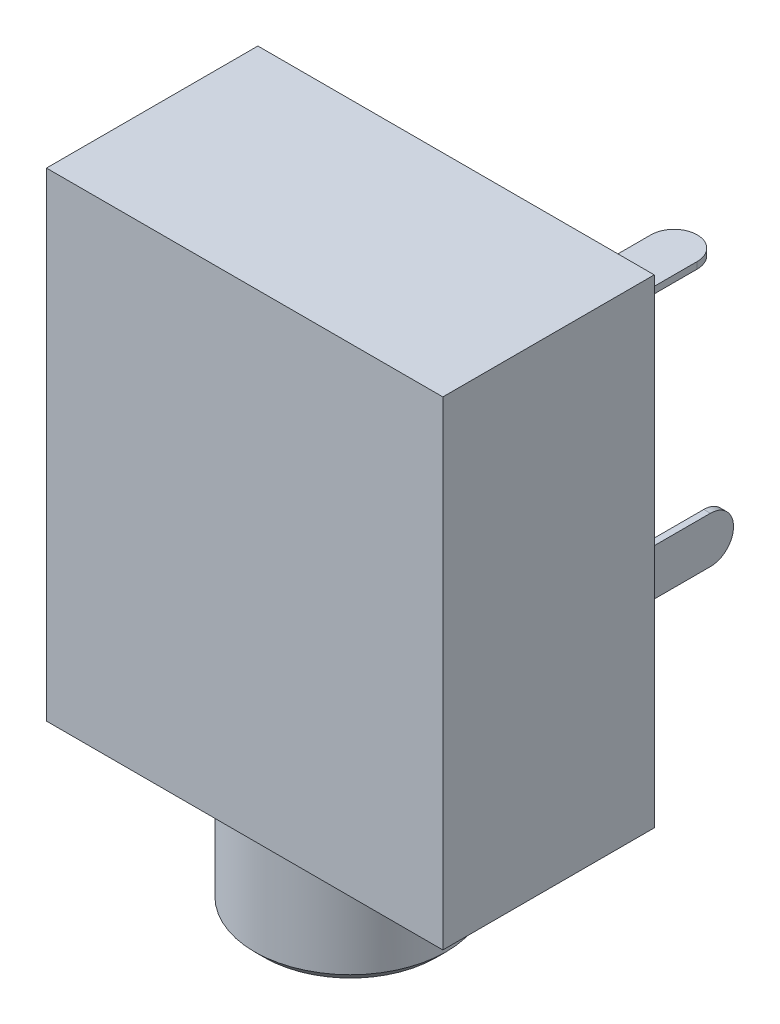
ISO-10303-21;
HEADER;
FILE_DESCRIPTION(('STEP AP214'),'2;1');
FILE_NAME('part.step','',(''),(''),'','','');
FILE_SCHEMA(('AUTOMOTIVE_DESIGN { 1 0 10303 214 1 1 1 1 }'));
ENDSEC;
DATA;
#1=APPLICATION_CONTEXT('core data for automotive mechanical design processes');
#2=APPLICATION_PROTOCOL_DEFINITION('international standard','automotive_design',2000,#1);
#3=PRODUCT_CONTEXT('',#1,'mechanical');
#4=PRODUCT('Part','Part','',(#3));
#5=PRODUCT_RELATED_PRODUCT_CATEGORY('part','',(#4));
#6=PRODUCT_DEFINITION_FORMATION('','',#4);
#7=PRODUCT_DEFINITION_CONTEXT('part definition',#1,'design');
#8=PRODUCT_DEFINITION('design','',#6,#7);
#9=PRODUCT_DEFINITION_SHAPE('','',#8);
#10=(LENGTH_UNIT() NAMED_UNIT(*) SI_UNIT(.MILLI.,.METRE.));
#11=(NAMED_UNIT(*) PLANE_ANGLE_UNIT() SI_UNIT($,.RADIAN.));
#12=(NAMED_UNIT(*) SI_UNIT($,.STERADIAN.) SOLID_ANGLE_UNIT());
#13=UNCERTAINTY_MEASURE_WITH_UNIT(LENGTH_MEASURE(1.E-05),#10,'distance_accuracy_value','');
#14=(GEOMETRIC_REPRESENTATION_CONTEXT(3) GLOBAL_UNCERTAINTY_ASSIGNED_CONTEXT((#13)) GLOBAL_UNIT_ASSIGNED_CONTEXT((#10,
#11,#12)) REPRESENTATION_CONTEXT('',''));
#15=CARTESIAN_POINT('',(0.,0.,0.));
#16=DIRECTION('',(0.,0.,1.));
#17=DIRECTION('',(1.,0.,0.));
#18=AXIS2_PLACEMENT_3D('',#15,#16,#17);
#19=CARTESIAN_POINT('',(0.,0.,6.4));
#20=DIRECTION('',(0.,1.,0.));
#21=DIRECTION('',(0.,0.,1.));
#22=AXIS2_PLACEMENT_3D('',#19,#20,#21);
#23=PLANE('',#22);
#24=DIRECTION('',(1.,0.,0.));
#25=VECTOR('',#24,1.);
#26=CARTESIAN_POINT('',(0.,0.,0.));
#27=LINE('',#26,#25);
#28=CARTESIAN_POINT('',(0.,0.,0.));
#29=VERTEX_POINT('',#28);
#30=CARTESIAN_POINT('',(12.,0.,0.));
#31=VERTEX_POINT('',#30);
#32=EDGE_CURVE('E331',#29,#31,#27,.T.);
#33=ORIENTED_EDGE('',*,*,#32,.T.);
#34=DIRECTION('',(0.,0.,-1.));
#35=VECTOR('',#34,1.);
#36=CARTESIAN_POINT('',(12.,0.,6.4));
#37=LINE('',#36,#35);
#38=CARTESIAN_POINT('',(12.,0.,6.4));
#39=VERTEX_POINT('',#38);
#40=EDGE_CURVE('E352',#39,#31,#37,.T.);
#41=ORIENTED_EDGE('',*,*,#40,.F.);
#42=DIRECTION('',(1.,0.,0.));
#43=VECTOR('',#42,1.);
#44=CARTESIAN_POINT('',(0.,0.,6.4));
#45=LINE('',#44,#43);
#46=CARTESIAN_POINT('',(0.,0.,6.4));
#47=VERTEX_POINT('',#46);
#48=EDGE_CURVE('E340',#47,#39,#45,.T.);
#49=ORIENTED_EDGE('',*,*,#48,.F.);
#50=DIRECTION('',(0.,0.,-1.));
#51=VECTOR('',#50,1.);
#52=CARTESIAN_POINT('',(0.,0.,6.4));
#53=LINE('',#52,#51);
#54=EDGE_CURVE('E355',#47,#29,#53,.T.);
#55=ORIENTED_EDGE('',*,*,#54,.T.);
#56=EDGE_LOOP('',(#33,#41,#49,#55));
#57=FACE_BOUND('',#56,.T.);
#58=CARTESIAN_POINT('',(6.,0.,3.2));
#59=DIRECTION('',(0.,1.,0.));
#60=DIRECTION('',(0.,0.,1.));
#61=AXIS2_PLACEMENT_3D('',#58,#59,#60);
#62=CIRCLE('',#61,2.9);
#63=CARTESIAN_POINT('',(6.,0.,6.1));
#64=VERTEX_POINT('',#63);
#65=EDGE_CURVE('E419',#64,#64,#62,.F.);
#66=ORIENTED_EDGE('',*,*,#65,.F.);
#67=EDGE_LOOP('',(#66));
#68=FACE_BOUND('',#67,.T.);
#69=ADVANCED_FACE('F24',(#57,#68),#23,.F.);
#70=CARTESIAN_POINT('',(0.,0.,0.));
#71=DIRECTION('',(0.,0.,1.));
#72=DIRECTION('',(1.,0.,0.));
#73=AXIS2_PLACEMENT_3D('',#70,#71,#72);
#74=PLANE('',#73);
#75=DIRECTION('',(0.,1.,0.));
#76=VECTOR('',#75,1.);
#77=CARTESIAN_POINT('',(1.2,10.,0.));
#78=LINE('',#77,#76);
#79=CARTESIAN_POINT('',(1.2,8.60000000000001,0.));
#80=VERTEX_POINT('',#79);
#81=CARTESIAN_POINT('',(1.2,10.,0.));
#82=VERTEX_POINT('',#81);
#83=EDGE_CURVE('E248',#80,#82,#78,.T.);
#84=ORIENTED_EDGE('',*,*,#83,.F.);
#85=DIRECTION('',(-1.,0.,0.));
#86=VECTOR('',#85,1.);
#87=CARTESIAN_POINT('',(1.2,8.60000000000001,0.));
#88=LINE('',#87,#86);
#89=CARTESIAN_POINT('',(1.4,8.60000000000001,0.));
#90=VERTEX_POINT('',#89);
#91=EDGE_CURVE('E257',#90,#80,#88,.T.);
#92=ORIENTED_EDGE('',*,*,#91,.F.);
#93=DIRECTION('',(0.,-1.,0.));
#94=VECTOR('',#93,1.);
#95=CARTESIAN_POINT('',(1.4,10.,0.));
#96=LINE('',#95,#94);
#97=CARTESIAN_POINT('',(1.4,10.,0.));
#98=VERTEX_POINT('',#97);
#99=EDGE_CURVE('E254',#98,#90,#96,.T.);
#100=ORIENTED_EDGE('',*,*,#99,.F.);
#101=DIRECTION('',(1.,0.,0.));
#102=VECTOR('',#101,1.);
#103=CARTESIAN_POINT('',(1.2,10.,0.));
#104=LINE('',#103,#102);
#105=EDGE_CURVE('E251',#82,#98,#104,.T.);
#106=ORIENTED_EDGE('',*,*,#105,.F.);
#107=EDGE_LOOP('',(#84,#92,#100,#106));
#108=FACE_BOUND('',#107,.T.);
#109=DIRECTION('',(0.,1.,0.));
#110=VECTOR('',#109,1.);
#111=CARTESIAN_POINT('',(10.7,6.30000000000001,0.));
#112=LINE('',#111,#110);
#113=CARTESIAN_POINT('',(10.7,4.9,0.));
#114=VERTEX_POINT('',#113);
#115=CARTESIAN_POINT('',(10.7,6.30000000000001,0.));
#116=VERTEX_POINT('',#115);
#117=EDGE_CURVE('E288',#114,#116,#112,.T.);
#118=ORIENTED_EDGE('',*,*,#117,.F.);
#119=DIRECTION('',(-1.,0.,0.));
#120=VECTOR('',#119,1.);
#121=CARTESIAN_POINT('',(10.7,4.9,0.));
#122=LINE('',#121,#120);
#123=CARTESIAN_POINT('',(10.9,4.9,0.));
#124=VERTEX_POINT('',#123);
#125=EDGE_CURVE('E297',#124,#114,#122,.T.);
#126=ORIENTED_EDGE('',*,*,#125,.F.);
#127=DIRECTION('',(0.,-1.,0.));
#128=VECTOR('',#127,1.);
#129=CARTESIAN_POINT('',(10.9,6.30000000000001,0.));
#130=LINE('',#129,#128);
#131=CARTESIAN_POINT('',(10.9,6.30000000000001,0.));
#132=VERTEX_POINT('',#131);
#133=EDGE_CURVE('E294',#132,#124,#130,.T.);
#134=ORIENTED_EDGE('',*,*,#133,.F.);
#135=DIRECTION('',(1.,0.,0.));
#136=VECTOR('',#135,1.);
#137=CARTESIAN_POINT('',(10.7,6.30000000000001,0.));
#138=LINE('',#137,#136);
#139=EDGE_CURVE('E291',#116,#132,#138,.T.);
#140=ORIENTED_EDGE('',*,*,#139,.F.);
#141=EDGE_LOOP('',(#118,#126,#134,#140));
#142=FACE_BOUND('',#141,.T.);
#143=DIRECTION('',(0.,-1.,0.));
#144=VECTOR('',#143,1.);
#145=CARTESIAN_POINT('',(0.,14.5,0.));
#146=LINE('',#145,#144);
#147=CARTESIAN_POINT('',(0.,14.5,0.));
#148=VERTEX_POINT('',#147);
#149=EDGE_CURVE('E328',#148,#29,#146,.T.);
#150=ORIENTED_EDGE('',*,*,#149,.F.);
#151=DIRECTION('',(-1.,0.,0.));
#152=VECTOR('',#151,1.);
#153=CARTESIAN_POINT('',(0.,14.5,0.));
#154=LINE('',#153,#152);
#155=CARTESIAN_POINT('',(12.,14.5,0.));
#156=VERTEX_POINT('',#155);
#157=EDGE_CURVE('E335',#156,#148,#154,.T.);
#158=ORIENTED_EDGE('',*,*,#157,.F.);
#159=DIRECTION('',(0.,1.,0.));
#160=VECTOR('',#159,1.);
#161=CARTESIAN_POINT('',(12.,14.5,0.));
#162=LINE('',#161,#160);
#163=EDGE_CURVE('E333',#31,#156,#162,.T.);
#164=ORIENTED_EDGE('',*,*,#163,.F.);
#165=ORIENTED_EDGE('',*,*,#32,.F.);
#166=EDGE_LOOP('',(#150,#158,#164,#165));
#167=FACE_BOUND('',#166,.T.);
#168=DIRECTION('',(0.,1.,0.));
#169=VECTOR('',#168,1.);
#170=CARTESIAN_POINT('',(9.10000000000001,12.5,0.));
#171=LINE('',#170,#169);
#172=CARTESIAN_POINT('',(9.10000000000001,12.5,0.));
#173=VERTEX_POINT('',#172);
#174=CARTESIAN_POINT('',(9.10000000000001,12.7,0.));
#175=VERTEX_POINT('',#174);
#176=EDGE_CURVE('E308',#173,#175,#171,.T.);
#177=ORIENTED_EDGE('',*,*,#176,.F.);
#178=DIRECTION('',(-1.,0.,0.));
#179=VECTOR('',#178,1.);
#180=CARTESIAN_POINT('',(9.10000000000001,12.5,0.));
#181=LINE('',#180,#179);
#182=CARTESIAN_POINT('',(10.5,12.5,0.));
#183=VERTEX_POINT('',#182);
#184=EDGE_CURVE('E317',#183,#173,#181,.T.);
#185=ORIENTED_EDGE('',*,*,#184,.F.);
#186=DIRECTION('',(0.,-1.,0.));
#187=VECTOR('',#186,1.);
#188=CARTESIAN_POINT('',(10.5,12.5,0.));
#189=LINE('',#188,#187);
#190=CARTESIAN_POINT('',(10.5,12.7,0.));
#191=VERTEX_POINT('',#190);
#192=EDGE_CURVE('E314',#191,#183,#189,.T.);
#193=ORIENTED_EDGE('',*,*,#192,.F.);
#194=DIRECTION('',(1.,0.,0.));
#195=VECTOR('',#194,1.);
#196=CARTESIAN_POINT('',(9.10000000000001,12.7,0.));
#197=LINE('',#196,#195);
#198=EDGE_CURVE('E311',#175,#191,#197,.T.);
#199=ORIENTED_EDGE('',*,*,#198,.F.);
#200=EDGE_LOOP('',(#177,#185,#193,#199));
#201=FACE_BOUND('',#200,.T.);
#202=DIRECTION('',(0.,1.,0.));
#203=VECTOR('',#202,1.);
#204=CARTESIAN_POINT('',(3.6,8.80000000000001,0.));
#205=LINE('',#204,#203);
#206=CARTESIAN_POINT('',(3.6,7.40000000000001,0.));
#207=VERTEX_POINT('',#206);
#208=CARTESIAN_POINT('',(3.6,8.80000000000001,0.));
#209=VERTEX_POINT('',#208);
#210=EDGE_CURVE('E268',#207,#209,#205,.T.);
#211=ORIENTED_EDGE('',*,*,#210,.F.);
#212=DIRECTION('',(-1.,0.,0.));
#213=VECTOR('',#212,1.);
#214=CARTESIAN_POINT('',(3.6,7.40000000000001,0.));
#215=LINE('',#214,#213);
#216=CARTESIAN_POINT('',(3.8,7.40000000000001,0.));
#217=VERTEX_POINT('',#216);
#218=EDGE_CURVE('E277',#217,#207,#215,.T.);
#219=ORIENTED_EDGE('',*,*,#218,.F.);
#220=DIRECTION('',(0.,-1.,0.));
#221=VECTOR('',#220,1.);
#222=CARTESIAN_POINT('',(3.8,8.80000000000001,0.));
#223=LINE('',#222,#221);
#224=CARTESIAN_POINT('',(3.8,8.80000000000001,0.));
#225=VERTEX_POINT('',#224);
#226=EDGE_CURVE('E274',#225,#217,#223,.T.);
#227=ORIENTED_EDGE('',*,*,#226,.F.);
#228=DIRECTION('',(1.,0.,0.));
#229=VECTOR('',#228,1.);
#230=CARTESIAN_POINT('',(3.6,8.80000000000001,0.));
#231=LINE('',#230,#229);
#232=EDGE_CURVE('E271',#209,#225,#231,.T.);
#233=ORIENTED_EDGE('',*,*,#232,.F.);
#234=EDGE_LOOP('',(#211,#219,#227,#233));
#235=FACE_BOUND('',#234,.T.);
#236=DIRECTION('',(0.,1.,0.));
#237=VECTOR('',#236,1.);
#238=CARTESIAN_POINT('',(5.30000000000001,0.700000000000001,0.));
#239=LINE('',#238,#237);
#240=CARTESIAN_POINT('',(5.30000000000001,0.700000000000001,0.));
#241=VERTEX_POINT('',#240);
#242=CARTESIAN_POINT('',(5.30000000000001,0.900000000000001,0.));
#243=VERTEX_POINT('',#242);
#244=EDGE_CURVE('E218',#241,#243,#239,.T.);
#245=ORIENTED_EDGE('',*,*,#244,.F.);
#246=DIRECTION('',(-1.,0.,0.));
#247=VECTOR('',#246,1.);
#248=CARTESIAN_POINT('',(5.30000000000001,0.700000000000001,0.));
#249=LINE('',#248,#247);
#250=CARTESIAN_POINT('',(6.70000000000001,0.700000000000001,0.));
#251=VERTEX_POINT('',#250);
#252=EDGE_CURVE('E224',#251,#241,#249,.T.);
#253=ORIENTED_EDGE('',*,*,#252,.F.);
#254=DIRECTION('',(0.,-1.,0.));
#255=VECTOR('',#254,1.);
#256=CARTESIAN_POINT('',(6.70000000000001,0.700000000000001,0.));
#257=LINE('',#256,#255);
#258=CARTESIAN_POINT('',(6.70000000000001,0.900000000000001,0.));
#259=VERTEX_POINT('',#258);
#260=EDGE_CURVE('E238',#259,#251,#257,.T.);
#261=ORIENTED_EDGE('',*,*,#260,.F.);
#262=DIRECTION('',(1.,0.,0.));
#263=VECTOR('',#262,1.);
#264=CARTESIAN_POINT('',(5.30000000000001,0.900000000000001,0.));
#265=LINE('',#264,#263);
#266=EDGE_CURVE('E233',#243,#259,#265,.T.);
#267=ORIENTED_EDGE('',*,*,#266,.F.);
#268=EDGE_LOOP('',(#245,#253,#261,#267));
#269=FACE_BOUND('',#268,.T.);
#270=ADVANCED_FACE('F229',(#108,#142,#167,#201,#235,#269),#74,.F.);
#271=CARTESIAN_POINT('',(0.,14.5,6.4));
#272=DIRECTION('',(1.,0.,0.));
#273=DIRECTION('',(0.,0.,-1.));
#274=AXIS2_PLACEMENT_3D('',#271,#272,#273);
#275=PLANE('',#274);
#276=ORIENTED_EDGE('',*,*,#149,.T.);
#277=ORIENTED_EDGE('',*,*,#54,.F.);
#278=DIRECTION('',(0.,-1.,0.));
#279=VECTOR('',#278,1.);
#280=CARTESIAN_POINT('',(0.,14.5,6.4));
#281=LINE('',#280,#279);
#282=CARTESIAN_POINT('',(0.,14.5,6.4));
#283=VERTEX_POINT('',#282);
#284=EDGE_CURVE('E337',#283,#47,#281,.T.);
#285=ORIENTED_EDGE('',*,*,#284,.F.);
#286=DIRECTION('',(0.,0.,-1.));
#287=VECTOR('',#286,1.);
#288=CARTESIAN_POINT('',(0.,14.5,6.4));
#289=LINE('',#288,#287);
#290=EDGE_CURVE('E346',#283,#148,#289,.T.);
#291=ORIENTED_EDGE('',*,*,#290,.T.);
#292=EDGE_LOOP('',(#276,#277,#285,#291));
#293=FACE_BOUND('',#292,.T.);
#294=ADVANCED_FACE('F26',(#293),#275,.F.);
#295=CARTESIAN_POINT('',(12.,14.5,6.4));
#296=DIRECTION('',(-1.,0.,0.));
#297=DIRECTION('',(0.,0.,1.));
#298=AXIS2_PLACEMENT_3D('',#295,#296,#297);
#299=PLANE('',#298);
#300=ORIENTED_EDGE('',*,*,#163,.T.);
#301=DIRECTION('',(0.,0.,-1.));
#302=VECTOR('',#301,1.);
#303=CARTESIAN_POINT('',(12.,14.5,6.4));
#304=LINE('',#303,#302);
#305=CARTESIAN_POINT('',(12.,14.5,6.4));
#306=VERTEX_POINT('',#305);
#307=EDGE_CURVE('E349',#306,#156,#304,.T.);
#308=ORIENTED_EDGE('',*,*,#307,.F.);
#309=DIRECTION('',(0.,1.,0.));
#310=VECTOR('',#309,1.);
#311=CARTESIAN_POINT('',(12.,14.5,6.4));
#312=LINE('',#311,#310);
#313=EDGE_CURVE('E342',#39,#306,#312,.T.);
#314=ORIENTED_EDGE('',*,*,#313,.F.);
#315=ORIENTED_EDGE('',*,*,#40,.T.);
#316=EDGE_LOOP('',(#300,#308,#314,#315));
#317=FACE_BOUND('',#316,.T.);
#318=ADVANCED_FACE('F454',(#317),#299,.F.);
#319=CARTESIAN_POINT('',(0.,14.5,6.4));
#320=DIRECTION('',(0.,-1.,0.));
#321=DIRECTION('',(0.,0.,-1.));
#322=AXIS2_PLACEMENT_3D('',#319,#320,#321);
#323=PLANE('',#322);
#324=ORIENTED_EDGE('',*,*,#157,.T.);
#325=ORIENTED_EDGE('',*,*,#290,.F.);
#326=DIRECTION('',(-1.,0.,0.));
#327=VECTOR('',#326,1.);
#328=CARTESIAN_POINT('',(0.,14.5,6.4));
#329=LINE('',#328,#327);
#330=EDGE_CURVE('E344',#306,#283,#329,.T.);
#331=ORIENTED_EDGE('',*,*,#330,.F.);
#332=ORIENTED_EDGE('',*,*,#307,.T.);
#333=EDGE_LOOP('',(#324,#325,#331,#332));
#334=FACE_BOUND('',#333,.T.);
#335=ADVANCED_FACE('F457',(#334),#323,.F.);
#336=CARTESIAN_POINT('',(0.,0.,6.4));
#337=DIRECTION('',(0.,0.,1.));
#338=DIRECTION('',(1.,0.,0.));
#339=AXIS2_PLACEMENT_3D('',#336,#337,#338);
#340=PLANE('',#339);
#341=ORIENTED_EDGE('',*,*,#284,.T.);
#342=ORIENTED_EDGE('',*,*,#48,.T.);
#343=ORIENTED_EDGE('',*,*,#313,.T.);
#344=ORIENTED_EDGE('',*,*,#330,.T.);
#345=EDGE_LOOP('',(#341,#342,#343,#344));
#346=FACE_BOUND('',#345,.T.);
#347=ADVANCED_FACE('F461',(#346),#340,.T.);
#348=CARTESIAN_POINT('',(9.10000000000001,12.5,-3.5));
#349=DIRECTION('',(1.,0.,0.));
#350=DIRECTION('',(0.,0.,-1.));
#351=AXIS2_PLACEMENT_3D('',#348,#349,#350);
#352=PLANE('',#351);
#353=DIRECTION('',(0.,0.,1.));
#354=VECTOR('',#353,1.);
#355=CARTESIAN_POINT('',(9.10000000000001,12.7,-3.5));
#356=LINE('',#355,#354);
#357=CARTESIAN_POINT('',(9.10000000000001,12.7,-2.8));
#358=VERTEX_POINT('',#357);
#359=EDGE_CURVE('E326',#358,#175,#356,.T.);
#360=ORIENTED_EDGE('',*,*,#359,.F.);
#361=DIRECTION('',(0.,1.,0.));
#362=VECTOR('',#361,1.);
#363=CARTESIAN_POINT('',(9.10000000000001,12.5,-2.8));
#364=LINE('',#363,#362);
#365=CARTESIAN_POINT('',(9.10000000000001,12.5,-2.8));
#366=VERTEX_POINT('',#365);
#367=EDGE_CURVE('E412',#358,#366,#364,.F.);
#368=ORIENTED_EDGE('',*,*,#367,.T.);
#369=DIRECTION('',(0.,0.,1.));
#370=VECTOR('',#369,1.);
#371=CARTESIAN_POINT('',(9.10000000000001,12.5,-3.5));
#372=LINE('',#371,#370);
#373=EDGE_CURVE('E320',#366,#173,#372,.T.);
#374=ORIENTED_EDGE('',*,*,#373,.T.);
#375=ORIENTED_EDGE('',*,*,#176,.T.);
#376=EDGE_LOOP('',(#360,#368,#374,#375));
#377=FACE_BOUND('',#376,.T.);
#378=ADVANCED_FACE('F464',(#377),#352,.F.);
#379=CARTESIAN_POINT('',(9.10000000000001,12.7,-3.5));
#380=DIRECTION('',(0.,-1.,0.));
#381=DIRECTION('',(0.,0.,-1.));
#382=AXIS2_PLACEMENT_3D('',#379,#380,#381);
#383=PLANE('',#382);
#384=CARTESIAN_POINT('',(9.80000000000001,12.7,-2.8));
#385=DIRECTION('',(0.,-1.,0.));
#386=DIRECTION('',(0.,0.,-1.));
#387=AXIS2_PLACEMENT_3D('',#384,#385,#386);
#388=CIRCLE('',#387,0.7);
#389=CARTESIAN_POINT('',(10.5,12.7,-2.8));
#390=VERTEX_POINT('',#389);
#391=CARTESIAN_POINT('',(9.80000000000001,12.7,-3.5));
#392=VERTEX_POINT('',#391);
#393=EDGE_CURVE('E408',#390,#392,#388,.F.);
#394=ORIENTED_EDGE('',*,*,#393,.T.);
#395=CARTESIAN_POINT('',(9.80000000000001,12.7,-2.8));
#396=DIRECTION('',(0.,-1.,0.));
#397=DIRECTION('',(0.,0.,-1.));
#398=AXIS2_PLACEMENT_3D('',#395,#396,#397);
#399=CIRCLE('',#398,0.7);
#400=EDGE_CURVE('E410',#392,#358,#399,.F.);
#401=ORIENTED_EDGE('',*,*,#400,.T.);
#402=ORIENTED_EDGE('',*,*,#359,.T.);
#403=ORIENTED_EDGE('',*,*,#198,.T.);
#404=DIRECTION('',(0.,0.,1.));
#405=VECTOR('',#404,1.);
#406=CARTESIAN_POINT('',(10.5,12.7,-3.5));
#407=LINE('',#406,#405);
#408=EDGE_CURVE('E324',#390,#191,#407,.T.);
#409=ORIENTED_EDGE('',*,*,#408,.F.);
#410=EDGE_LOOP('',(#394,#401,#402,#403,#409));
#411=FACE_BOUND('',#410,.T.);
#412=ADVANCED_FACE('F469',(#411),#383,.F.);
#413=CARTESIAN_POINT('',(10.5,12.5,-3.5));
#414=DIRECTION('',(-1.,0.,0.));
#415=DIRECTION('',(0.,0.,1.));
#416=AXIS2_PLACEMENT_3D('',#413,#414,#415);
#417=PLANE('',#416);
#418=DIRECTION('',(0.,0.,1.));
#419=VECTOR('',#418,1.);
#420=CARTESIAN_POINT('',(10.5,12.5,-3.5));
#421=LINE('',#420,#419);
#422=CARTESIAN_POINT('',(10.5,12.5,-2.8));
#423=VERTEX_POINT('',#422);
#424=EDGE_CURVE('E322',#423,#183,#421,.T.);
#425=ORIENTED_EDGE('',*,*,#424,.F.);
#426=DIRECTION('',(0.,-1.,0.));
#427=VECTOR('',#426,1.);
#428=CARTESIAN_POINT('',(10.5,12.7,-2.8));
#429=LINE('',#428,#427);
#430=EDGE_CURVE('E417',#423,#390,#429,.F.);
#431=ORIENTED_EDGE('',*,*,#430,.T.);
#432=ORIENTED_EDGE('',*,*,#408,.T.);
#433=ORIENTED_EDGE('',*,*,#192,.T.);
#434=EDGE_LOOP('',(#425,#431,#432,#433));
#435=FACE_BOUND('',#434,.T.);
#436=ADVANCED_FACE('F473',(#435),#417,.F.);
#437=CARTESIAN_POINT('',(9.10000000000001,12.5,-3.5));
#438=DIRECTION('',(0.,1.,0.));
#439=DIRECTION('',(0.,0.,1.));
#440=AXIS2_PLACEMENT_3D('',#437,#438,#439);
#441=PLANE('',#440);
#442=ORIENTED_EDGE('',*,*,#373,.F.);
#443=CARTESIAN_POINT('',(9.80000000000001,12.5,-2.8));
#444=DIRECTION('',(0.,1.,0.));
#445=DIRECTION('',(0.,0.,1.));
#446=AXIS2_PLACEMENT_3D('',#443,#444,#445);
#447=CIRCLE('',#446,0.7);
#448=CARTESIAN_POINT('',(9.80000000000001,12.5,-3.5));
#449=VERTEX_POINT('',#448);
#450=EDGE_CURVE('E44',#366,#449,#447,.F.);
#451=ORIENTED_EDGE('',*,*,#450,.T.);
#452=CARTESIAN_POINT('',(9.80000000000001,12.5,-2.8));
#453=DIRECTION('',(0.,1.,0.));
#454=DIRECTION('',(0.,0.,1.));
#455=AXIS2_PLACEMENT_3D('',#452,#453,#454);
#456=CIRCLE('',#455,0.7);
#457=EDGE_CURVE('E39',#449,#423,#456,.F.);
#458=ORIENTED_EDGE('',*,*,#457,.T.);
#459=ORIENTED_EDGE('',*,*,#424,.T.);
#460=ORIENTED_EDGE('',*,*,#184,.T.);
#461=EDGE_LOOP('',(#442,#451,#458,#459,#460));
#462=FACE_BOUND('',#461,.T.);
#463=ADVANCED_FACE('F477',(#462),#441,.F.);
#464=CARTESIAN_POINT('',(10.7,6.30000000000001,-3.5));
#465=DIRECTION('',(1.,0.,0.));
#466=DIRECTION('',(0.,0.,-1.));
#467=AXIS2_PLACEMENT_3D('',#464,#465,#466);
#468=PLANE('',#467);
#469=CARTESIAN_POINT('',(10.7,5.60000000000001,-2.8));
#470=DIRECTION('',(1.,0.,0.));
#471=DIRECTION('',(0.,0.,-1.));
#472=AXIS2_PLACEMENT_3D('',#469,#470,#471);
#473=CIRCLE('',#472,0.7);
#474=CARTESIAN_POINT('',(10.7,6.30000000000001,-2.8));
#475=VERTEX_POINT('',#474);
#476=CARTESIAN_POINT('',(10.7,5.60000000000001,-3.5));
#477=VERTEX_POINT('',#476);
#478=EDGE_CURVE('E395',#475,#477,#473,.F.);
#479=ORIENTED_EDGE('',*,*,#478,.T.);
#480=CARTESIAN_POINT('',(10.7,5.6,-2.8));
#481=DIRECTION('',(1.,0.,0.));
#482=DIRECTION('',(0.,0.,-1.));
#483=AXIS2_PLACEMENT_3D('',#480,#481,#482);
#484=CIRCLE('',#483,0.7);
#485=CARTESIAN_POINT('',(10.7,4.9,-2.8));
#486=VERTEX_POINT('',#485);
#487=EDGE_CURVE('E397',#477,#486,#484,.F.);
#488=ORIENTED_EDGE('',*,*,#487,.T.);
#489=DIRECTION('',(0.,0.,1.));
#490=VECTOR('',#489,1.);
#491=CARTESIAN_POINT('',(10.7,4.9,-3.5));
#492=LINE('',#491,#490);
#493=EDGE_CURVE('E300',#486,#114,#492,.T.);
#494=ORIENTED_EDGE('',*,*,#493,.T.);
#495=ORIENTED_EDGE('',*,*,#117,.T.);
#496=DIRECTION('',(0.,0.,1.));
#497=VECTOR('',#496,1.);
#498=CARTESIAN_POINT('',(10.7,6.30000000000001,-3.5));
#499=LINE('',#498,#497);
#500=EDGE_CURVE('E306',#475,#116,#499,.T.);
#501=ORIENTED_EDGE('',*,*,#500,.F.);
#502=EDGE_LOOP('',(#479,#488,#494,#495,#501));
#503=FACE_BOUND('',#502,.T.);
#504=ADVANCED_FACE('F481',(#503),#468,.F.);
#505=CARTESIAN_POINT('',(10.7,6.30000000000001,-3.5));
#506=DIRECTION('',(0.,-1.,0.));
#507=DIRECTION('',(0.,0.,-1.));
#508=AXIS2_PLACEMENT_3D('',#505,#506,#507);
#509=PLANE('',#508);
#510=DIRECTION('',(0.,0.,1.));
#511=VECTOR('',#510,1.);
#512=CARTESIAN_POINT('',(10.9,6.30000000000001,-3.5));
#513=LINE('',#512,#511);
#514=CARTESIAN_POINT('',(10.9,6.30000000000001,-2.8));
#515=VERTEX_POINT('',#514);
#516=EDGE_CURVE('E304',#515,#132,#513,.T.);
#517=ORIENTED_EDGE('',*,*,#516,.F.);
#518=DIRECTION('',(1.,0.,0.));
#519=VECTOR('',#518,1.);
#520=CARTESIAN_POINT('',(10.7,6.30000000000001,-2.8));
#521=LINE('',#520,#519);
#522=EDGE_CURVE('E406',#515,#475,#521,.F.);
#523=ORIENTED_EDGE('',*,*,#522,.T.);
#524=ORIENTED_EDGE('',*,*,#500,.T.);
#525=ORIENTED_EDGE('',*,*,#139,.T.);
#526=EDGE_LOOP('',(#517,#523,#524,#525));
#527=FACE_BOUND('',#526,.T.);
#528=ADVANCED_FACE('F484',(#527),#509,.F.);
#529=CARTESIAN_POINT('',(10.9,6.30000000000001,-3.5));
#530=DIRECTION('',(-1.,0.,0.));
#531=DIRECTION('',(0.,0.,1.));
#532=AXIS2_PLACEMENT_3D('',#529,#530,#531);
#533=PLANE('',#532);
#534=DIRECTION('',(0.,0.,1.));
#535=VECTOR('',#534,1.);
#536=CARTESIAN_POINT('',(10.9,4.9,-3.5));
#537=LINE('',#536,#535);
#538=CARTESIAN_POINT('',(10.9,4.9,-2.8));
#539=VERTEX_POINT('',#538);
#540=EDGE_CURVE('E302',#539,#124,#537,.T.);
#541=ORIENTED_EDGE('',*,*,#540,.F.);
#542=CARTESIAN_POINT('',(10.9,5.6,-2.8));
#543=DIRECTION('',(-1.,0.,0.));
#544=DIRECTION('',(0.,0.,1.));
#545=AXIS2_PLACEMENT_3D('',#542,#543,#544);
#546=CIRCLE('',#545,0.7);
#547=CARTESIAN_POINT('',(10.9,5.60000000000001,-3.5));
#548=VERTEX_POINT('',#547);
#549=EDGE_CURVE('E404',#539,#548,#546,.F.);
#550=ORIENTED_EDGE('',*,*,#549,.T.);
#551=CARTESIAN_POINT('',(10.9,5.60000000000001,-2.8));
#552=DIRECTION('',(-1.,0.,0.));
#553=DIRECTION('',(0.,0.,1.));
#554=AXIS2_PLACEMENT_3D('',#551,#552,#553);
#555=CIRCLE('',#554,0.7);
#556=EDGE_CURVE('E402',#548,#515,#555,.F.);
#557=ORIENTED_EDGE('',*,*,#556,.T.);
#558=ORIENTED_EDGE('',*,*,#516,.T.);
#559=ORIENTED_EDGE('',*,*,#133,.T.);
#560=EDGE_LOOP('',(#541,#550,#557,#558,#559));
#561=FACE_BOUND('',#560,.T.);
#562=ADVANCED_FACE('F488',(#561),#533,.F.);
#563=CARTESIAN_POINT('',(10.7,4.9,-3.5));
#564=DIRECTION('',(0.,1.,0.));
#565=DIRECTION('',(0.,0.,1.));
#566=AXIS2_PLACEMENT_3D('',#563,#564,#565);
#567=PLANE('',#566);
#568=ORIENTED_EDGE('',*,*,#493,.F.);
#569=DIRECTION('',(-1.,0.,0.));
#570=VECTOR('',#569,1.);
#571=CARTESIAN_POINT('',(10.7,4.9,-2.8));
#572=LINE('',#571,#570);
#573=EDGE_CURVE('E399',#486,#539,#572,.F.);
#574=ORIENTED_EDGE('',*,*,#573,.T.);
#575=ORIENTED_EDGE('',*,*,#540,.T.);
#576=ORIENTED_EDGE('',*,*,#125,.T.);
#577=EDGE_LOOP('',(#568,#574,#575,#576));
#578=FACE_BOUND('',#577,.T.);
#579=ADVANCED_FACE('F492',(#578),#567,.F.);
#580=CARTESIAN_POINT('',(3.6,8.80000000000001,-3.5));
#581=DIRECTION('',(1.,0.,0.));
#582=DIRECTION('',(0.,0.,-1.));
#583=AXIS2_PLACEMENT_3D('',#580,#581,#582);
#584=PLANE('',#583);
#585=DIRECTION('',(0.,0.,1.));
#586=VECTOR('',#585,1.);
#587=CARTESIAN_POINT('',(3.6,8.80000000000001,-3.5));
#588=LINE('',#587,#586);
#589=CARTESIAN_POINT('',(3.6,8.80000000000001,-2.8));
#590=VERTEX_POINT('',#589);
#591=EDGE_CURVE('E286',#590,#209,#588,.T.);
#592=ORIENTED_EDGE('',*,*,#591,.F.);
#593=CARTESIAN_POINT('',(3.6,8.10000000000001,-2.8));
#594=DIRECTION('',(1.,0.,0.));
#595=DIRECTION('',(0.,0.,-1.));
#596=AXIS2_PLACEMENT_3D('',#593,#594,#595);
#597=CIRCLE('',#596,0.7);
#598=CARTESIAN_POINT('',(3.6,8.10000000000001,-3.5));
#599=VERTEX_POINT('',#598);
#600=EDGE_CURVE('E380',#590,#599,#597,.F.);
#601=ORIENTED_EDGE('',*,*,#600,.T.);
#602=CARTESIAN_POINT('',(3.6,8.10000000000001,-2.8));
#603=DIRECTION('',(1.,0.,0.));
#604=DIRECTION('',(0.,0.,-1.));
#605=AXIS2_PLACEMENT_3D('',#602,#603,#604);
#606=CIRCLE('',#605,0.7);
#607=CARTESIAN_POINT('',(3.6,7.40000000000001,-2.8));
#608=VERTEX_POINT('',#607);
#609=EDGE_CURVE('E378',#599,#608,#606,.F.);
#610=ORIENTED_EDGE('',*,*,#609,.T.);
#611=DIRECTION('',(0.,0.,1.));
#612=VECTOR('',#611,1.);
#613=CARTESIAN_POINT('',(3.6,7.40000000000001,-3.5));
#614=LINE('',#613,#612);
#615=EDGE_CURVE('E280',#608,#207,#614,.T.);
#616=ORIENTED_EDGE('',*,*,#615,.T.);
#617=ORIENTED_EDGE('',*,*,#210,.T.);
#618=EDGE_LOOP('',(#592,#601,#610,#616,#617));
#619=FACE_BOUND('',#618,.T.);
#620=ADVANCED_FACE('F496',(#619),#584,.F.);
#621=CARTESIAN_POINT('',(3.6,8.80000000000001,-3.5));
#622=DIRECTION('',(0.,-1.,0.));
#623=DIRECTION('',(0.,0.,-1.));
#624=AXIS2_PLACEMENT_3D('',#621,#622,#623);
#625=PLANE('',#624);
#626=DIRECTION('',(0.,0.,1.));
#627=VECTOR('',#626,1.);
#628=CARTESIAN_POINT('',(3.8,8.80000000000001,-3.5));
#629=LINE('',#628,#627);
#630=CARTESIAN_POINT('',(3.8,8.80000000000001,-2.8));
#631=VERTEX_POINT('',#630);
#632=EDGE_CURVE('E284',#631,#225,#629,.T.);
#633=ORIENTED_EDGE('',*,*,#632,.F.);
#634=DIRECTION('',(1.,0.,0.));
#635=VECTOR('',#634,1.);
#636=CARTESIAN_POINT('',(3.6,8.80000000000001,-2.8));
#637=LINE('',#636,#635);
#638=EDGE_CURVE('E375',#631,#590,#637,.F.);
#639=ORIENTED_EDGE('',*,*,#638,.T.);
#640=ORIENTED_EDGE('',*,*,#591,.T.);
#641=ORIENTED_EDGE('',*,*,#232,.T.);
#642=EDGE_LOOP('',(#633,#639,#640,#641));
#643=FACE_BOUND('',#642,.T.);
#644=ADVANCED_FACE('F500',(#643),#625,.F.);
#645=CARTESIAN_POINT('',(3.8,8.80000000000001,-3.5));
#646=DIRECTION('',(-1.,0.,0.));
#647=DIRECTION('',(0.,0.,1.));
#648=AXIS2_PLACEMENT_3D('',#645,#646,#647);
#649=PLANE('',#648);
#650=CARTESIAN_POINT('',(3.8,8.10000000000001,-2.8));
#651=DIRECTION('',(-1.,0.,0.));
#652=DIRECTION('',(0.,0.,1.));
#653=AXIS2_PLACEMENT_3D('',#650,#651,#652);
#654=CIRCLE('',#653,0.7);
#655=CARTESIAN_POINT('',(3.8,7.40000000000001,-2.8));
#656=VERTEX_POINT('',#655);
#657=CARTESIAN_POINT('',(3.8,8.10000000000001,-3.5));
#658=VERTEX_POINT('',#657);
#659=EDGE_CURVE('E371',#656,#658,#654,.F.);
#660=ORIENTED_EDGE('',*,*,#659,.T.);
#661=CARTESIAN_POINT('',(3.8,8.10000000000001,-2.8));
#662=DIRECTION('',(-1.,0.,0.));
#663=DIRECTION('',(0.,0.,1.));
#664=AXIS2_PLACEMENT_3D('',#661,#662,#663);
#665=CIRCLE('',#664,0.7);
#666=EDGE_CURVE('E373',#658,#631,#665,.F.);
#667=ORIENTED_EDGE('',*,*,#666,.T.);
#668=ORIENTED_EDGE('',*,*,#632,.T.);
#669=ORIENTED_EDGE('',*,*,#226,.T.);
#670=DIRECTION('',(0.,0.,1.));
#671=VECTOR('',#670,1.);
#672=CARTESIAN_POINT('',(3.8,7.40000000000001,-3.5));
#673=LINE('',#672,#671);
#674=EDGE_CURVE('E282',#656,#217,#673,.T.);
#675=ORIENTED_EDGE('',*,*,#674,.F.);
#676=EDGE_LOOP('',(#660,#667,#668,#669,#675));
#677=FACE_BOUND('',#676,.T.);
#678=ADVANCED_FACE('F504',(#677),#649,.F.);
#679=CARTESIAN_POINT('',(3.6,7.40000000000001,-3.5));
#680=DIRECTION('',(0.,1.,0.));
#681=DIRECTION('',(0.,0.,1.));
#682=AXIS2_PLACEMENT_3D('',#679,#680,#681);
#683=PLANE('',#682);
#684=ORIENTED_EDGE('',*,*,#615,.F.);
#685=DIRECTION('',(-1.,0.,0.));
#686=VECTOR('',#685,1.);
#687=CARTESIAN_POINT('',(3.6,7.40000000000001,-2.8));
#688=LINE('',#687,#686);
#689=EDGE_CURVE('E382',#608,#656,#688,.F.);
#690=ORIENTED_EDGE('',*,*,#689,.T.);
#691=ORIENTED_EDGE('',*,*,#674,.T.);
#692=ORIENTED_EDGE('',*,*,#218,.T.);
#693=EDGE_LOOP('',(#684,#690,#691,#692));
#694=FACE_BOUND('',#693,.T.);
#695=ADVANCED_FACE('F508',(#694),#683,.F.);
#696=CARTESIAN_POINT('',(1.2,10.,-3.5));
#697=DIRECTION('',(1.,0.,0.));
#698=DIRECTION('',(0.,0.,-1.));
#699=AXIS2_PLACEMENT_3D('',#696,#697,#698);
#700=PLANE('',#699);
#701=DIRECTION('',(0.,0.,1.));
#702=VECTOR('',#701,1.);
#703=CARTESIAN_POINT('',(1.2,10.,-3.5));
#704=LINE('',#703,#702);
#705=CARTESIAN_POINT('',(1.2,10.,-2.8));
#706=VERTEX_POINT('',#705);
#707=EDGE_CURVE('E266',#706,#82,#704,.T.);
#708=ORIENTED_EDGE('',*,*,#707,.F.);
#709=CARTESIAN_POINT('',(1.2,9.30000000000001,-2.8));
#710=DIRECTION('',(1.,0.,0.));
#711=DIRECTION('',(0.,0.,-1.));
#712=AXIS2_PLACEMENT_3D('',#709,#710,#711);
#713=CIRCLE('',#712,0.7);
#714=CARTESIAN_POINT('',(1.2,9.30000000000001,-3.5));
#715=VERTEX_POINT('',#714);
#716=EDGE_CURVE('E367',#706,#715,#713,.F.);
#717=ORIENTED_EDGE('',*,*,#716,.T.);
#718=CARTESIAN_POINT('',(1.2,9.30000000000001,-2.8));
#719=DIRECTION('',(1.,0.,0.));
#720=DIRECTION('',(0.,0.,-1.));
#721=AXIS2_PLACEMENT_3D('',#718,#719,#720);
#722=CIRCLE('',#721,0.7);
#723=CARTESIAN_POINT('',(1.2,8.60000000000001,-2.8));
#724=VERTEX_POINT('',#723);
#725=EDGE_CURVE('E365',#715,#724,#722,.F.);
#726=ORIENTED_EDGE('',*,*,#725,.T.);
#727=DIRECTION('',(0.,0.,1.));
#728=VECTOR('',#727,1.);
#729=CARTESIAN_POINT('',(1.2,8.60000000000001,-3.5));
#730=LINE('',#729,#728);
#731=EDGE_CURVE('E260',#724,#80,#730,.T.);
#732=ORIENTED_EDGE('',*,*,#731,.T.);
#733=ORIENTED_EDGE('',*,*,#83,.T.);
#734=EDGE_LOOP('',(#708,#717,#726,#732,#733));
#735=FACE_BOUND('',#734,.T.);
#736=ADVANCED_FACE('F512',(#735),#700,.F.);
#737=CARTESIAN_POINT('',(1.2,10.,-3.5));
#738=DIRECTION('',(0.,-1.,0.));
#739=DIRECTION('',(0.,0.,-1.));
#740=AXIS2_PLACEMENT_3D('',#737,#738,#739);
#741=PLANE('',#740);
#742=DIRECTION('',(0.,0.,1.));
#743=VECTOR('',#742,1.);
#744=CARTESIAN_POINT('',(1.4,10.,-3.5));
#745=LINE('',#744,#743);
#746=CARTESIAN_POINT('',(1.4,10.,-2.8));
#747=VERTEX_POINT('',#746);
#748=EDGE_CURVE('E264',#747,#98,#745,.T.);
#749=ORIENTED_EDGE('',*,*,#748,.F.);
#750=DIRECTION('',(1.,0.,0.));
#751=VECTOR('',#750,1.);
#752=CARTESIAN_POINT('',(1.2,10.,-2.8));
#753=LINE('',#752,#751);
#754=EDGE_CURVE('E362',#747,#706,#753,.F.);
#755=ORIENTED_EDGE('',*,*,#754,.T.);
#756=ORIENTED_EDGE('',*,*,#707,.T.);
#757=ORIENTED_EDGE('',*,*,#105,.T.);
#758=EDGE_LOOP('',(#749,#755,#756,#757));
#759=FACE_BOUND('',#758,.T.);
#760=ADVANCED_FACE('F516',(#759),#741,.F.);
#761=CARTESIAN_POINT('',(1.4,10.,-3.5));
#762=DIRECTION('',(-1.,0.,0.));
#763=DIRECTION('',(0.,0.,1.));
#764=AXIS2_PLACEMENT_3D('',#761,#762,#763);
#765=PLANE('',#764);
#766=CARTESIAN_POINT('',(1.4,9.30000000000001,-2.8));
#767=DIRECTION('',(-1.,0.,0.));
#768=DIRECTION('',(0.,0.,1.));
#769=AXIS2_PLACEMENT_3D('',#766,#767,#768);
#770=CIRCLE('',#769,0.7);
#771=CARTESIAN_POINT('',(1.4,8.60000000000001,-2.8));
#772=VERTEX_POINT('',#771);
#773=CARTESIAN_POINT('',(1.4,9.30000000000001,-3.5));
#774=VERTEX_POINT('',#773);
#775=EDGE_CURVE('E358',#772,#774,#770,.F.);
#776=ORIENTED_EDGE('',*,*,#775,.T.);
#777=CARTESIAN_POINT('',(1.4,9.30000000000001,-2.8));
#778=DIRECTION('',(-1.,0.,0.));
#779=DIRECTION('',(0.,0.,1.));
#780=AXIS2_PLACEMENT_3D('',#777,#778,#779);
#781=CIRCLE('',#780,0.7);
#782=EDGE_CURVE('E360',#774,#747,#781,.F.);
#783=ORIENTED_EDGE('',*,*,#782,.T.);
#784=ORIENTED_EDGE('',*,*,#748,.T.);
#785=ORIENTED_EDGE('',*,*,#99,.T.);
#786=DIRECTION('',(0.,0.,1.));
#787=VECTOR('',#786,1.);
#788=CARTESIAN_POINT('',(1.4,8.60000000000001,-3.5));
#789=LINE('',#788,#787);
#790=EDGE_CURVE('E262',#772,#90,#789,.T.);
#791=ORIENTED_EDGE('',*,*,#790,.F.);
#792=EDGE_LOOP('',(#776,#783,#784,#785,#791));
#793=FACE_BOUND('',#792,.T.);
#794=ADVANCED_FACE('F520',(#793),#765,.F.);
#795=CARTESIAN_POINT('',(1.2,8.60000000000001,-3.5));
#796=DIRECTION('',(0.,1.,0.));
#797=DIRECTION('',(0.,0.,1.));
#798=AXIS2_PLACEMENT_3D('',#795,#796,#797);
#799=PLANE('',#798);
#800=ORIENTED_EDGE('',*,*,#731,.F.);
#801=DIRECTION('',(-1.,0.,0.));
#802=VECTOR('',#801,1.);
#803=CARTESIAN_POINT('',(1.2,8.60000000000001,-2.8));
#804=LINE('',#803,#802);
#805=EDGE_CURVE('E369',#724,#772,#804,.F.);
#806=ORIENTED_EDGE('',*,*,#805,.T.);
#807=ORIENTED_EDGE('',*,*,#790,.T.);
#808=ORIENTED_EDGE('',*,*,#91,.T.);
#809=EDGE_LOOP('',(#800,#806,#807,#808));
#810=FACE_BOUND('',#809,.T.);
#811=ADVANCED_FACE('F524',(#810),#799,.F.);
#812=CARTESIAN_POINT('',(5.30000000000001,0.700000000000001,-3.5));
#813=DIRECTION('',(1.,0.,0.));
#814=DIRECTION('',(0.,0.,-1.));
#815=AXIS2_PLACEMENT_3D('',#812,#813,#814);
#816=PLANE('',#815);
#817=DIRECTION('',(0.,0.,1.));
#818=VECTOR('',#817,1.);
#819=CARTESIAN_POINT('',(5.30000000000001,0.900000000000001,-3.5));
#820=LINE('',#819,#818);
#821=CARTESIAN_POINT('',(5.30000000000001,0.900000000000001,-2.8));
#822=VERTEX_POINT('',#821);
#823=EDGE_CURVE('E246',#822,#243,#820,.T.);
#824=ORIENTED_EDGE('',*,*,#823,.F.);
#825=DIRECTION('',(0.,1.,0.));
#826=VECTOR('',#825,1.);
#827=CARTESIAN_POINT('',(5.30000000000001,0.700000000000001,-2.8));
#828=LINE('',#827,#826);
#829=CARTESIAN_POINT('',(5.30000000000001,0.700000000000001,-2.8));
#830=VERTEX_POINT('',#829);
#831=EDGE_CURVE('E220',#822,#830,#828,.F.);
#832=ORIENTED_EDGE('',*,*,#831,.T.);
#833=DIRECTION('',(0.,0.,1.));
#834=VECTOR('',#833,1.);
#835=CARTESIAN_POINT('',(5.30000000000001,0.700000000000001,-3.5));
#836=LINE('',#835,#834);
#837=EDGE_CURVE('E214',#830,#241,#836,.T.);
#838=ORIENTED_EDGE('',*,*,#837,.T.);
#839=ORIENTED_EDGE('',*,*,#244,.T.);
#840=EDGE_LOOP('',(#824,#832,#838,#839));
#841=FACE_BOUND('',#840,.T.);
#842=ADVANCED_FACE('F217',(#841),#816,.F.);
#843=CARTESIAN_POINT('',(5.30000000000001,0.900000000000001,-3.5));
#844=DIRECTION('',(0.,-1.,0.));
#845=DIRECTION('',(0.,0.,-1.));
#846=AXIS2_PLACEMENT_3D('',#843,#844,#845);
#847=PLANE('',#846);
#848=CARTESIAN_POINT('',(6.00000000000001,0.900000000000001,-2.8));
#849=DIRECTION('',(0.,-1.,0.));
#850=DIRECTION('',(0.,0.,-1.));
#851=AXIS2_PLACEMENT_3D('',#848,#849,#850);
#852=CIRCLE('',#851,0.7);
#853=CARTESIAN_POINT('',(6.70000000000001,0.900000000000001,-2.8));
#854=VERTEX_POINT('',#853);
#855=CARTESIAN_POINT('',(6.00000000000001,0.900000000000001,-3.5));
#856=VERTEX_POINT('',#855);
#857=EDGE_CURVE('E384',#854,#856,#852,.F.);
#858=ORIENTED_EDGE('',*,*,#857,.T.);
#859=CARTESIAN_POINT('',(6.00000000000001,0.900000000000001,-2.8));
#860=DIRECTION('',(0.,-1.,0.));
#861=DIRECTION('',(0.,0.,-1.));
#862=AXIS2_PLACEMENT_3D('',#859,#860,#861);
#863=CIRCLE('',#862,0.7);
#864=EDGE_CURVE('E386',#856,#822,#863,.F.);
#865=ORIENTED_EDGE('',*,*,#864,.T.);
#866=ORIENTED_EDGE('',*,*,#823,.T.);
#867=ORIENTED_EDGE('',*,*,#266,.T.);
#868=DIRECTION('',(0.,0.,1.));
#869=VECTOR('',#868,1.);
#870=CARTESIAN_POINT('',(6.70000000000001,0.900000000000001,-3.5));
#871=LINE('',#870,#869);
#872=EDGE_CURVE('E244',#854,#259,#871,.T.);
#873=ORIENTED_EDGE('',*,*,#872,.F.);
#874=EDGE_LOOP('',(#858,#865,#866,#867,#873));
#875=FACE_BOUND('',#874,.T.);
#876=ADVANCED_FACE('F531',(#875),#847,.F.);
#877=CARTESIAN_POINT('',(6.70000000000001,0.700000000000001,-3.5));
#878=DIRECTION('',(-1.,0.,0.));
#879=DIRECTION('',(0.,0.,1.));
#880=AXIS2_PLACEMENT_3D('',#877,#878,#879);
#881=PLANE('',#880);
#882=DIRECTION('',(0.,0.,1.));
#883=VECTOR('',#882,1.);
#884=CARTESIAN_POINT('',(6.70000000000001,0.700000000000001,-3.5));
#885=LINE('',#884,#883);
#886=CARTESIAN_POINT('',(6.70000000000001,0.700000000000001,-2.8));
#887=VERTEX_POINT('',#886);
#888=EDGE_CURVE('E223',#887,#251,#885,.T.);
#889=ORIENTED_EDGE('',*,*,#888,.F.);
#890=DIRECTION('',(0.,-1.,0.));
#891=VECTOR('',#890,1.);
#892=CARTESIAN_POINT('',(6.70000000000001,0.900000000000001,-2.8));
#893=LINE('',#892,#891);
#894=EDGE_CURVE('E393',#887,#854,#893,.F.);
#895=ORIENTED_EDGE('',*,*,#894,.T.);
#896=ORIENTED_EDGE('',*,*,#872,.T.);
#897=ORIENTED_EDGE('',*,*,#260,.T.);
#898=EDGE_LOOP('',(#889,#895,#896,#897));
#899=FACE_BOUND('',#898,.T.);
#900=ADVANCED_FACE('F534',(#899),#881,.F.);
#901=CARTESIAN_POINT('',(5.30000000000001,0.700000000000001,-3.5));
#902=DIRECTION('',(0.,1.,0.));
#903=DIRECTION('',(0.,0.,1.));
#904=AXIS2_PLACEMENT_3D('',#901,#902,#903);
#905=PLANE('',#904);
#906=ORIENTED_EDGE('',*,*,#837,.F.);
#907=CARTESIAN_POINT('',(6.00000000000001,0.700000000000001,-2.8));
#908=DIRECTION('',(0.,1.,0.));
#909=DIRECTION('',(0.,0.,1.));
#910=AXIS2_PLACEMENT_3D('',#907,#908,#909);
#911=CIRCLE('',#910,0.7);
#912=CARTESIAN_POINT('',(6.00000000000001,0.700000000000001,-3.5));
#913=VERTEX_POINT('',#912);
#914=EDGE_CURVE('E391',#830,#913,#911,.F.);
#915=ORIENTED_EDGE('',*,*,#914,.T.);
#916=CARTESIAN_POINT('',(6.00000000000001,0.700000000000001,-2.8));
#917=DIRECTION('',(0.,1.,0.));
#918=DIRECTION('',(0.,0.,1.));
#919=AXIS2_PLACEMENT_3D('',#916,#917,#918);
#920=CIRCLE('',#919,0.7);
#921=EDGE_CURVE('E389',#913,#887,#920,.F.);
#922=ORIENTED_EDGE('',*,*,#921,.T.);
#923=ORIENTED_EDGE('',*,*,#888,.T.);
#924=ORIENTED_EDGE('',*,*,#252,.T.);
#925=EDGE_LOOP('',(#906,#915,#922,#923,#924));
#926=FACE_BOUND('',#925,.T.);
#927=ADVANCED_FACE('F236',(#926),#905,.F.);
#928=CARTESIAN_POINT('',(1.2,9.30000000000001,-2.8));
#929=DIRECTION('',(-1.,0.,0.));
#930=DIRECTION('',(0.,0.,1.));
#931=AXIS2_PLACEMENT_3D('',#928,#929,#930);
#932=CYLINDRICAL_SURFACE('',#931,0.7);
#933=ORIENTED_EDGE('',*,*,#805,.F.);
#934=ORIENTED_EDGE('',*,*,#725,.F.);
#935=DIRECTION('',(-1.,0.,0.));
#936=VECTOR('',#935,1.);
#937=CARTESIAN_POINT('',(1.2,9.30000000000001,-3.5));
#938=LINE('',#937,#936);
#939=EDGE_CURVE('E234',#774,#715,#938,.T.);
#940=ORIENTED_EDGE('',*,*,#939,.F.);
#941=ORIENTED_EDGE('',*,*,#775,.F.);
#942=EDGE_LOOP('',(#933,#934,#940,#941));
#943=FACE_BOUND('',#942,.T.);
#944=ADVANCED_FACE('F541',(#943),#932,.T.);
#945=CARTESIAN_POINT('',(1.2,9.30000000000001,-2.8));
#946=DIRECTION('',(1.,0.,0.));
#947=DIRECTION('',(0.,0.,-1.));
#948=AXIS2_PLACEMENT_3D('',#945,#946,#947);
#949=CYLINDRICAL_SURFACE('',#948,0.7);
#950=ORIENTED_EDGE('',*,*,#716,.F.);
#951=ORIENTED_EDGE('',*,*,#754,.F.);
#952=ORIENTED_EDGE('',*,*,#782,.F.);
#953=ORIENTED_EDGE('',*,*,#939,.T.);
#954=EDGE_LOOP('',(#950,#951,#952,#953));
#955=FACE_BOUND('',#954,.T.);
#956=ADVANCED_FACE('F544',(#955),#949,.T.);
#957=CARTESIAN_POINT('',(3.6,8.10000000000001,-2.8));
#958=DIRECTION('',(-1.,0.,0.));
#959=DIRECTION('',(0.,0.,1.));
#960=AXIS2_PLACEMENT_3D('',#957,#958,#959);
#961=CYLINDRICAL_SURFACE('',#960,0.7);
#962=ORIENTED_EDGE('',*,*,#689,.F.);
#963=ORIENTED_EDGE('',*,*,#609,.F.);
#964=DIRECTION('',(-1.,0.,0.));
#965=VECTOR('',#964,1.);
#966=CARTESIAN_POINT('',(3.6,8.10000000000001,-3.5));
#967=LINE('',#966,#965);
#968=EDGE_CURVE('E609',#658,#599,#967,.T.);
#969=ORIENTED_EDGE('',*,*,#968,.F.);
#970=ORIENTED_EDGE('',*,*,#659,.F.);
#971=EDGE_LOOP('',(#962,#963,#969,#970));
#972=FACE_BOUND('',#971,.T.);
#973=ADVANCED_FACE('F548',(#972),#961,.T.);
#974=CARTESIAN_POINT('',(3.6,8.10000000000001,-2.8));
#975=DIRECTION('',(1.,0.,0.));
#976=DIRECTION('',(0.,0.,-1.));
#977=AXIS2_PLACEMENT_3D('',#974,#975,#976);
#978=CYLINDRICAL_SURFACE('',#977,0.7);
#979=ORIENTED_EDGE('',*,*,#600,.F.);
#980=ORIENTED_EDGE('',*,*,#638,.F.);
#981=ORIENTED_EDGE('',*,*,#666,.F.);
#982=ORIENTED_EDGE('',*,*,#968,.T.);
#983=EDGE_LOOP('',(#979,#980,#981,#982));
#984=FACE_BOUND('',#983,.T.);
#985=ADVANCED_FACE('F552',(#984),#978,.T.);
#986=CARTESIAN_POINT('',(6.00000000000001,0.900000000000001,-2.8));
#987=DIRECTION('',(0.,1.,0.));
#988=DIRECTION('',(0.,0.,1.));
#989=AXIS2_PLACEMENT_3D('',#986,#987,#988);
#990=CYLINDRICAL_SURFACE('',#989,0.7);
#991=ORIENTED_EDGE('',*,*,#894,.F.);
#992=ORIENTED_EDGE('',*,*,#921,.F.);
#993=DIRECTION('',(0.,-1.,0.));
#994=VECTOR('',#993,1.);
#995=CARTESIAN_POINT('',(6.00000000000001,0.700000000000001,-3.5));
#996=LINE('',#995,#994);
#997=EDGE_CURVE('E606',#856,#913,#996,.T.);
#998=ORIENTED_EDGE('',*,*,#997,.F.);
#999=ORIENTED_EDGE('',*,*,#857,.F.);
#1000=EDGE_LOOP('',(#991,#992,#998,#999));
#1001=FACE_BOUND('',#1000,.T.);
#1002=ADVANCED_FACE('F556',(#1001),#990,.T.);
#1003=CARTESIAN_POINT('',(6.00000000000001,0.900000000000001,-2.8));
#1004=DIRECTION('',(0.,-1.,0.));
#1005=DIRECTION('',(0.,0.,-1.));
#1006=AXIS2_PLACEMENT_3D('',#1003,#1004,#1005);
#1007=CYLINDRICAL_SURFACE('',#1006,0.7);
#1008=ORIENTED_EDGE('',*,*,#914,.F.);
#1009=ORIENTED_EDGE('',*,*,#831,.F.);
#1010=ORIENTED_EDGE('',*,*,#864,.F.);
#1011=ORIENTED_EDGE('',*,*,#997,.T.);
#1012=EDGE_LOOP('',(#1008,#1009,#1010,#1011));
#1013=FACE_BOUND('',#1012,.T.);
#1014=ADVANCED_FACE('F560',(#1013),#1007,.T.);
#1015=CARTESIAN_POINT('',(10.7,5.60000000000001,-2.8));
#1016=DIRECTION('',(1.,0.,0.));
#1017=DIRECTION('',(0.,0.,-1.));
#1018=AXIS2_PLACEMENT_3D('',#1015,#1016,#1017);
#1019=CYLINDRICAL_SURFACE('',#1018,0.7);
#1020=ORIENTED_EDGE('',*,*,#522,.F.);
#1021=ORIENTED_EDGE('',*,*,#556,.F.);
#1022=DIRECTION('',(1.,0.,0.));
#1023=VECTOR('',#1022,1.);
#1024=CARTESIAN_POINT('',(10.7,5.60000000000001,-3.5));
#1025=LINE('',#1024,#1023);
#1026=EDGE_CURVE('E601',#477,#548,#1025,.T.);
#1027=ORIENTED_EDGE('',*,*,#1026,.F.);
#1028=ORIENTED_EDGE('',*,*,#478,.F.);
#1029=EDGE_LOOP('',(#1020,#1021,#1027,#1028));
#1030=FACE_BOUND('',#1029,.T.);
#1031=ADVANCED_FACE('F564',(#1030),#1019,.T.);
#1032=CARTESIAN_POINT('',(10.7,5.6,-2.8));
#1033=DIRECTION('',(-1.,0.,0.));
#1034=DIRECTION('',(0.,0.,1.));
#1035=AXIS2_PLACEMENT_3D('',#1032,#1033,#1034);
#1036=CYLINDRICAL_SURFACE('',#1035,0.7);
#1037=ORIENTED_EDGE('',*,*,#549,.F.);
#1038=ORIENTED_EDGE('',*,*,#573,.F.);
#1039=ORIENTED_EDGE('',*,*,#487,.F.);
#1040=ORIENTED_EDGE('',*,*,#1026,.T.);
#1041=EDGE_LOOP('',(#1037,#1038,#1039,#1040));
#1042=FACE_BOUND('',#1041,.T.);
#1043=ADVANCED_FACE('F568',(#1042),#1036,.T.);
#1044=CARTESIAN_POINT('',(9.80000000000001,12.7,-2.8));
#1045=DIRECTION('',(0.,1.,0.));
#1046=DIRECTION('',(0.,0.,1.));
#1047=AXIS2_PLACEMENT_3D('',#1044,#1045,#1046);
#1048=CYLINDRICAL_SURFACE('',#1047,0.7);
#1049=ORIENTED_EDGE('',*,*,#430,.F.);
#1050=ORIENTED_EDGE('',*,*,#457,.F.);
#1051=DIRECTION('',(0.,-1.,0.));
#1052=VECTOR('',#1051,1.);
#1053=CARTESIAN_POINT('',(9.80000000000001,12.5,-3.5));
#1054=LINE('',#1053,#1052);
#1055=EDGE_CURVE('E598',#392,#449,#1054,.T.);
#1056=ORIENTED_EDGE('',*,*,#1055,.F.);
#1057=ORIENTED_EDGE('',*,*,#393,.F.);
#1058=EDGE_LOOP('',(#1049,#1050,#1056,#1057));
#1059=FACE_BOUND('',#1058,.T.);
#1060=ADVANCED_FACE('F572',(#1059),#1048,.T.);
#1061=CARTESIAN_POINT('',(9.80000000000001,12.7,-2.8));
#1062=DIRECTION('',(0.,-1.,0.));
#1063=DIRECTION('',(0.,0.,-1.));
#1064=AXIS2_PLACEMENT_3D('',#1061,#1062,#1063);
#1065=CYLINDRICAL_SURFACE('',#1064,0.7);
#1066=ORIENTED_EDGE('',*,*,#450,.F.);
#1067=ORIENTED_EDGE('',*,*,#367,.F.);
#1068=ORIENTED_EDGE('',*,*,#400,.F.);
#1069=ORIENTED_EDGE('',*,*,#1055,.T.);
#1070=EDGE_LOOP('',(#1066,#1067,#1068,#1069));
#1071=FACE_BOUND('',#1070,.T.);
#1072=ADVANCED_FACE('F576',(#1071),#1065,.T.);
#1073=CARTESIAN_POINT('',(6.,-3.5,3.2));
#1074=DIRECTION('',(0.,-1.,0.));
#1075=DIRECTION('',(0.,0.,-1.));
#1076=AXIS2_PLACEMENT_3D('',#1073,#1074,#1075);
#1077=PLANE('',#1076);
#1078=CARTESIAN_POINT('',(6.,-3.5,3.2));
#1079=DIRECTION('',(0.,-1.,0.));
#1080=DIRECTION('',(0.,0.,-1.));
#1081=AXIS2_PLACEMENT_3D('',#1078,#1079,#1080);
#1082=CIRCLE('',#1081,2.2);
#1083=CARTESIAN_POINT('',(6.,-3.5,0.999999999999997));
#1084=VERTEX_POINT('',#1083);
#1085=EDGE_CURVE('E11',#1084,#1084,#1082,.F.);
#1086=ORIENTED_EDGE('',*,*,#1085,.T.);
#1087=EDGE_LOOP('',(#1086));
#1088=FACE_BOUND('',#1087,.T.);
#1089=CARTESIAN_POINT('',(6.,-3.5,3.2));
#1090=DIRECTION('',(0.,-1.,0.));
#1091=DIRECTION('',(0.,0.,-1.));
#1092=AXIS2_PLACEMENT_3D('',#1089,#1090,#1091);
#1093=CIRCLE('',#1092,2.6);
#1094=CARTESIAN_POINT('',(6.,-3.5,0.6));
#1095=VERTEX_POINT('',#1094);
#1096=EDGE_CURVE('E422',#1095,#1095,#1093,.T.);
#1097=ORIENTED_EDGE('',*,*,#1096,.T.);
#1098=EDGE_LOOP('',(#1097));
#1099=FACE_BOUND('',#1098,.T.);
#1100=ADVANCED_FACE('F580',(#1088,#1099),#1077,.T.);
#1101=CARTESIAN_POINT('',(6.,-3.5,3.2));
#1102=DIRECTION('',(0.,1.,0.));
#1103=DIRECTION('',(0.,0.,1.));
#1104=AXIS2_PLACEMENT_3D('',#1101,#1102,#1103);
#1105=CYLINDRICAL_SURFACE('',#1104,2.9);
#1106=CARTESIAN_POINT('',(6.,-3.2,3.2));
#1107=DIRECTION('',(0.,-1.,0.));
#1108=DIRECTION('',(0.,0.,-1.));
#1109=AXIS2_PLACEMENT_3D('',#1106,#1107,#1108);
#1110=CIRCLE('',#1109,2.9);
#1111=CARTESIAN_POINT('',(6.,-3.2,0.3));
#1112=VERTEX_POINT('',#1111);
#1113=EDGE_CURVE('E425',#1112,#1112,#1110,.F.);
#1114=ORIENTED_EDGE('',*,*,#1113,.T.);
#1115=EDGE_LOOP('',(#1114));
#1116=FACE_BOUND('',#1115,.T.);
#1117=ORIENTED_EDGE('',*,*,#65,.T.);
#1118=EDGE_LOOP('',(#1117));
#1119=FACE_BOUND('',#1118,.T.);
#1120=ADVANCED_FACE('F582',(#1116,#1119),#1105,.T.);
#1121=CARTESIAN_POINT('',(6.,-3.5,3.2));
#1122=DIRECTION('',(0.,1.,0.));
#1123=DIRECTION('',(0.,0.,1.));
#1124=AXIS2_PLACEMENT_3D('',#1121,#1122,#1123);
#1125=CYLINDRICAL_SURFACE('',#1124,1.7);
#1126=CARTESIAN_POINT('',(6.,-3.,3.2));
#1127=DIRECTION('',(0.,-1.,0.));
#1128=DIRECTION('',(0.,0.,-1.));
#1129=AXIS2_PLACEMENT_3D('',#1126,#1127,#1128);
#1130=CIRCLE('',#1129,1.7);
#1131=CARTESIAN_POINT('',(6.,-3.,1.5));
#1132=VERTEX_POINT('',#1131);
#1133=EDGE_CURVE('E32',#1132,#1132,#1130,.T.);
#1134=ORIENTED_EDGE('',*,*,#1133,.T.);
#1135=EDGE_LOOP('',(#1134));
#1136=FACE_BOUND('',#1135,.T.);
#1137=CARTESIAN_POINT('',(6.,13.5,3.2));
#1138=DIRECTION('',(0.,-1.,0.));
#1139=DIRECTION('',(0.,0.,-1.));
#1140=AXIS2_PLACEMENT_3D('',#1137,#1138,#1139);
#1141=CIRCLE('',#1140,1.7);
#1142=CARTESIAN_POINT('',(6.,13.5,1.5));
#1143=VERTEX_POINT('',#1142);
#1144=EDGE_CURVE('E597',#1143,#1143,#1141,.T.);
#1145=ORIENTED_EDGE('',*,*,#1144,.F.);
#1146=EDGE_LOOP('',(#1145));
#1147=FACE_BOUND('',#1146,.T.);
#1148=ADVANCED_FACE('F430',(#1136,#1147),#1125,.F.);
#1149=CARTESIAN_POINT('',(6.,13.5,3.2));
#1150=DIRECTION('',(0.,-1.,0.));
#1151=DIRECTION('',(0.,0.,-1.));
#1152=AXIS2_PLACEMENT_3D('',#1149,#1150,#1151);
#1153=PLANE('',#1152);
#1154=ORIENTED_EDGE('',*,*,#1144,.T.);
#1155=EDGE_LOOP('',(#1154));
#1156=FACE_BOUND('',#1155,.T.);
#1157=ADVANCED_FACE('F441',(#1156),#1153,.T.);
#1158=CARTESIAN_POINT('',(6.,-3.5,3.2));
#1159=DIRECTION('',(0.,1.,0.));
#1160=DIRECTION('',(0.,0.,1.));
#1161=AXIS2_PLACEMENT_3D('',#1158,#1159,#1160);
#1162=CONICAL_SURFACE('',#1161,2.6,0.785398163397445);
#1163=ORIENTED_EDGE('',*,*,#1113,.F.);
#1164=EDGE_LOOP('',(#1163));
#1165=FACE_BOUND('',#1164,.T.);
#1166=ORIENTED_EDGE('',*,*,#1096,.F.);
#1167=EDGE_LOOP('',(#1166));
#1168=FACE_BOUND('',#1167,.T.);
#1169=ADVANCED_FACE('F435',(#1165,#1168),#1162,.T.);
#1170=CARTESIAN_POINT('',(6.,-3.,3.2));
#1171=DIRECTION('',(0.,-1.,0.));
#1172=DIRECTION('',(0.,0.,-1.));
#1173=AXIS2_PLACEMENT_3D('',#1170,#1171,#1172);
#1174=CONICAL_SURFACE('',#1173,1.7,0.785398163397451);
#1175=ORIENTED_EDGE('',*,*,#1085,.F.);
#1176=EDGE_LOOP('',(#1175));
#1177=FACE_BOUND('',#1176,.T.);
#1178=ORIENTED_EDGE('',*,*,#1133,.F.);
#1179=EDGE_LOOP('',(#1178));
#1180=FACE_BOUND('',#1179,.T.);
#1181=ADVANCED_FACE('F433',(#1177,#1180),#1174,.F.);
#1182=CLOSED_SHELL('',(#69,#270,#294,#318,#335,#347,#378,#412,#436,#463,#504,#528,#562,#579,
#620,#644,#678,#695,#736,#760,#794,#811,#842,#876,#900,#927,#944,#956,#973,#985,#1002,#1014,
#1031,#1043,#1060,#1072,#1100,#1120,#1148,#1157,#1169,#1181));
#1183=MANIFOLD_SOLID_BREP('B2',#1182);
#1184=ADVANCED_BREP_SHAPE_REPRESENTATION('',(#18,#1183),#14);
#1185=SHAPE_DEFINITION_REPRESENTATION(#9,#1184);
ENDSEC;
END-ISO-10303-21;
